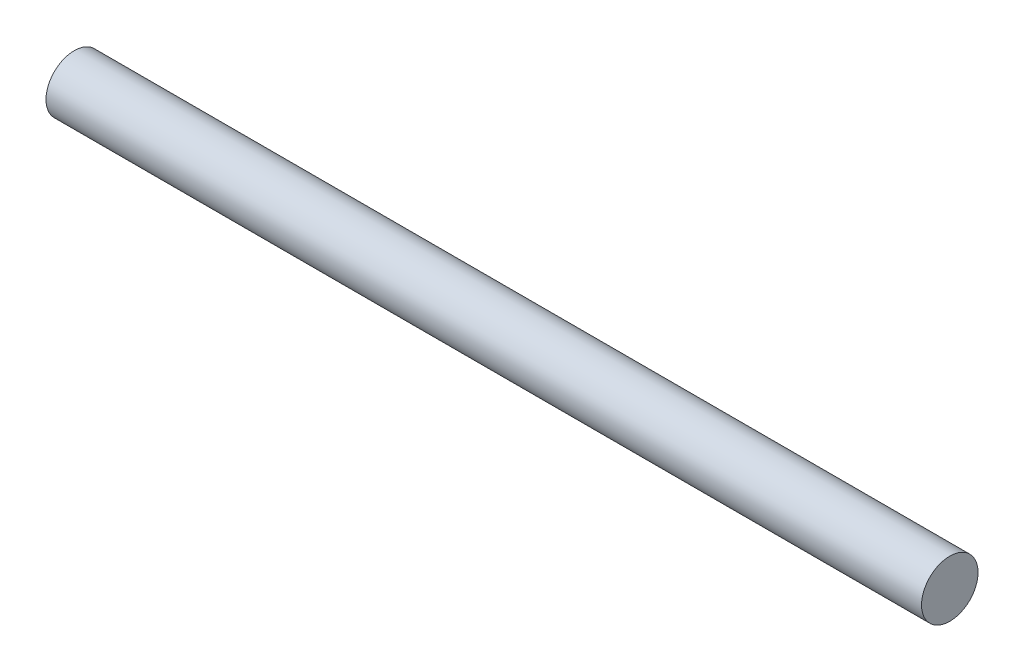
from build123d import *

# Parameters (mm, degrees)
SKIZZE1_W = 32.528571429
SKIZZE1_H = 1.05


with BuildPart() as part:
    # Skizze1 → Rotation1 (revolve)
    with BuildSketch(Plane.XY, mode=Mode.PRIVATE) as rotation1_sk:
        with Locations((1.371428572, -0.525)):
            Rectangle(SKIZZE1_W, SKIZZE1_H)
    revolve(rotation1_sk.sketch.rotate(Axis((-21.938117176, 0, 0), (1, 0, 0)), 270), axis=Axis((-21.938117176, 0, 0), (1, 0, 0)))


solid = part.part
